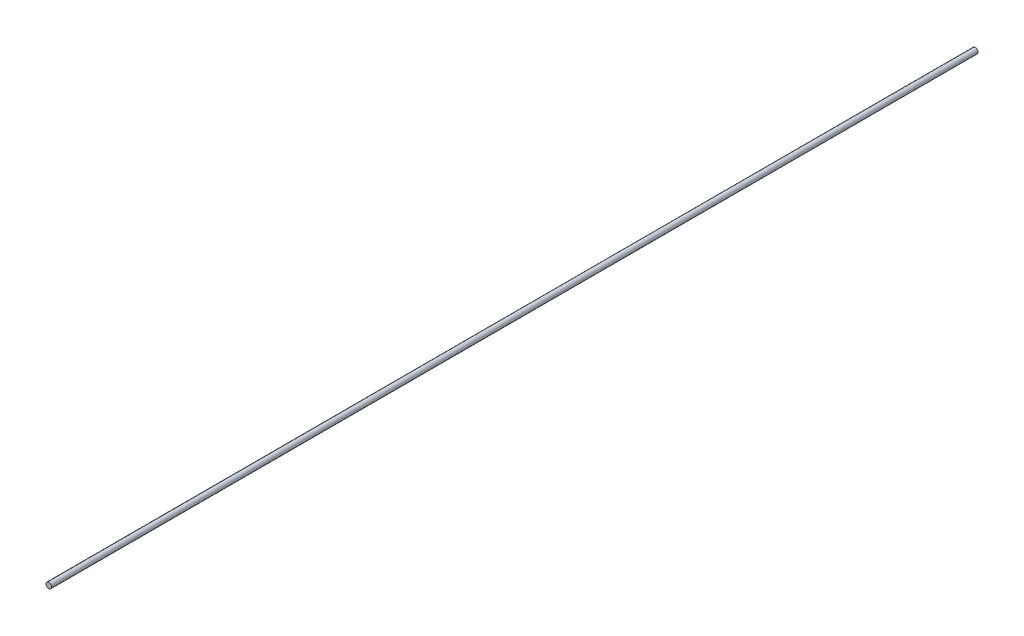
from build123d import *

# Parameters (mm, degrees)
ESQUISSE1_R      = 1.35
EXTRUSION1_DEPTH = 450


with BuildPart() as part:
    # Esquisse1 → Extrusion1 (new body)
    with BuildSketch(Plane.XY):
        Circle(ESQUISSE1_R)
    extrude(amount=EXTRUSION1_DEPTH)


solid = part.part
